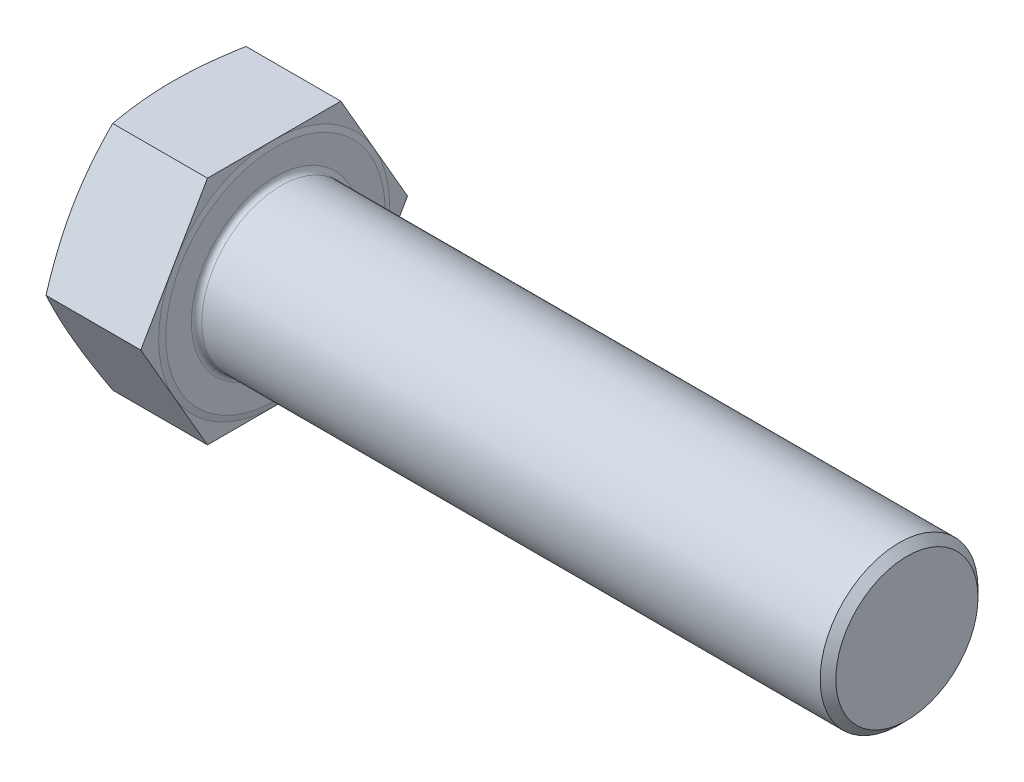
from build123d import *

# Parameters (mm, degrees)
BASEHEAD_DEPTH = 38.5
SKETCH3_R      = 30
BASEBODY_DEPTH = 240
HEADFILLET_R   = 2
CHAMFER1_SIZE  = 2.977


with BuildPart() as part:
    # Sketch-BaseHead → BaseHead (new body)
    with BuildSketch(Plane(origin=(0, 0, 0), x_dir=(0, 0, -1), z_dir=(1, 0, 0))):
        Polygon((50.691353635, 0), (25.345676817, 43.9), (-25.345676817, 43.9), (-50.691353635, 0), (-25.345676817, -43.9), (25.345676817, -43.9), align=None)
    extrude(amount=BASEHEAD_DEPTH)

    # Sketch4 → HeadChamfer (revolve, cut)
    with BuildSketch(Plane(origin=(-0.264637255, 0, 5.916896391), x_dir=(0, 0, -1), z_dir=(0, 1, 0))):
        Polygon((56.608250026, -0.264637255), (49.816896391, -0.264637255), (56.608250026, -2.736487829), align=None)
    revolve(axis=Axis((-4.001564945, 0, 0), (1, 0, 0)), mode=Mode.SUBTRACT)

    # Sketch1 → Revolve1 (revolve)
    with BuildSketch(Plane.XY, mode=Mode.PRIVATE) as revolve1_sk:
        Polygon((38.5, 0), (39, 0), (39, -41.705), (38.5, -43.9), align=None)
    revolve(revolve1_sk.sketch.rotate(Axis((-4.001564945, 0, 0), (1, 0, 0)), 270), axis=Axis((-4.001564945, 0, 0), (1, 0, 0)))

    # Sketch3 → BaseBody (add)
    with BuildSketch(Plane(origin=(39, 0, 0), x_dir=(0, 0, -1), z_dir=(1, 0, 0))):
        Circle(SKETCH3_R)
    extrude(amount=BASEBODY_DEPTH)

    # HeadFillet
    headfillet_edges = [part.edges().sort_by_distance(p)[0] for p in [
        (39, 0, 30),
    ]]
    fillet(headfillet_edges, radius=HEADFILLET_R)

    # Chamfer1
    chamfer1_edges = [part.edges().sort_by_distance(p)[0] for p in [
        (279, 0, 30),
    ]]
    chamfer(chamfer1_edges, length=CHAMFER1_SIZE)


solid = part.part
